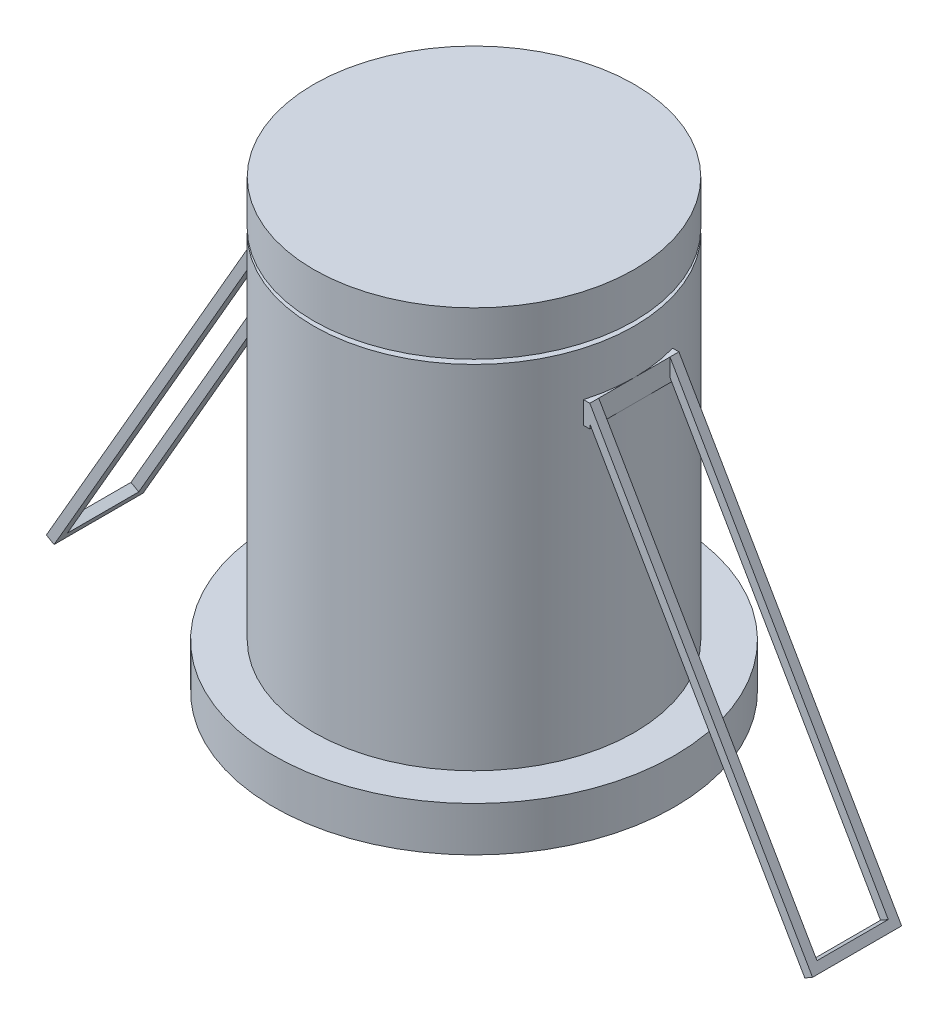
from build123d import *

# Parameters (mm, degrees)
CROQUIS2_W              = 10
CROQUIS2_H              = 2.5
SALIENTE_EXTRUIR1_DEPTH = 0.708383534
SALIENTE_EXTRUIR2_DEPTH = 1


with BuildPart() as part:
    # Croquis1 → Revoluci_n1 (revolve)
    with BuildSketch(Plane.XY, mode=Mode.PRIVATE) as revoluci_n1_sk:
        Polygon((-17, 45), (-17, 44.5), (-18, 44.5), (-18, 5), (-22.5, 5), (-22.5, 0), (-15, 0), (-15, 15), (0, 15), (0, 50), (-18, 50), (-18, 45), align=None)
    revolve(revoluci_n1_sk.sketch.rotate(Axis((0, 15, 0), (0, 1, 0)), 180), axis=Axis((0, 15, 0), (0, 1, 0)))

    # Croquis2 → Saliente-Extruir1 (add)
    with BuildSketch(Plane(origin=(18, 0, 0), x_dir=(0, 0, -1), z_dir=(1, 0, 0))):
        with Locations((0, 38.25)):
            Rectangle(CROQUIS2_W, CROQUIS2_H)
    saliente_extruir1 = extrude(amount=-SALIENTE_EXTRUIR1_DEPTH)

    # Croquis3 → Saliente-Extruir2 (add)
    with BuildSketch(Plane(origin=(30.604001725, 17.669228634, 0), x_dir=(0, 0, 1), z_dir=(0.866025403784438, 0.500000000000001, 0))):
        Polygon((4, -25.208003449), (4, 23.791996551), (-4, 23.791996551), (-4, -25.208003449), (-5, -25.208003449), (-5, 24.791996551), (5, 24.791996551), (5, -25.208003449), align=None)
    saliente_extruir2 = extrude(amount=-SALIENTE_EXTRUIR2_DEPTH)

    # Simetr_a1: Saliente-Extruir1, Saliente-Extruir2 across plane
    add(saliente_extruir1.mirror(Plane(origin=(0, 0, 0), x_dir=(0, 0, 1), z_dir=(1, 0, 0))))
    add(saliente_extruir2.mirror(Plane(origin=(0, 0, 0), x_dir=(0, 0, 1), z_dir=(1, 0, 0))))


solid = part.part
